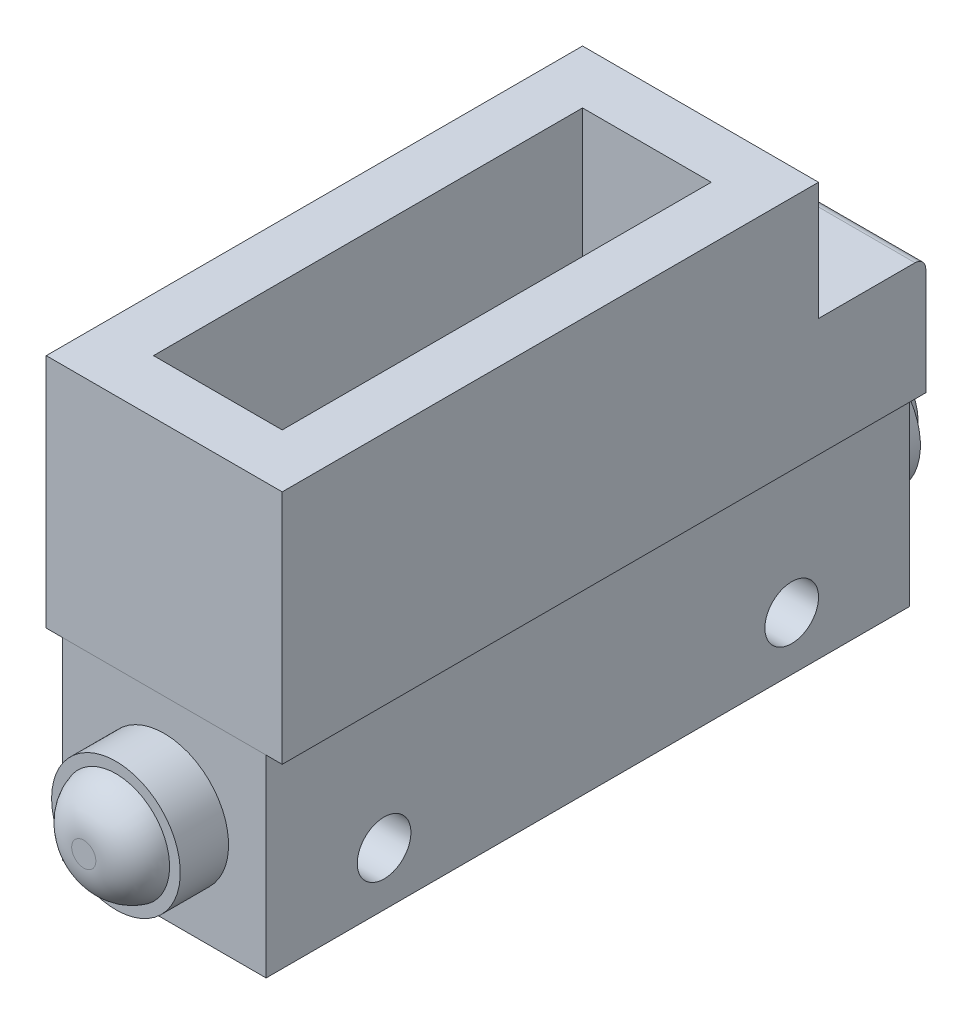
ISO-10303-21;
HEADER;
FILE_DESCRIPTION(('STEP AP214'),'2;1');
FILE_NAME('part.step','',(''),(''),'','','');
FILE_SCHEMA(('AUTOMOTIVE_DESIGN { 1 0 10303 214 1 1 1 1 }'));
ENDSEC;
DATA;
#1=APPLICATION_CONTEXT('core data for automotive mechanical design processes');
#2=APPLICATION_PROTOCOL_DEFINITION('international standard','automotive_design',2000,#1);
#3=PRODUCT_CONTEXT('',#1,'mechanical');
#4=PRODUCT('Part','Part','',(#3));
#5=PRODUCT_RELATED_PRODUCT_CATEGORY('part','',(#4));
#6=PRODUCT_DEFINITION_FORMATION('','',#4);
#7=PRODUCT_DEFINITION_CONTEXT('part definition',#1,'design');
#8=PRODUCT_DEFINITION('design','',#6,#7);
#9=PRODUCT_DEFINITION_SHAPE('','',#8);
#10=(LENGTH_UNIT() NAMED_UNIT(*) SI_UNIT(.MILLI.,.METRE.));
#11=(NAMED_UNIT(*) PLANE_ANGLE_UNIT() SI_UNIT($,.RADIAN.));
#12=(NAMED_UNIT(*) SI_UNIT($,.STERADIAN.) SOLID_ANGLE_UNIT());
#13=UNCERTAINTY_MEASURE_WITH_UNIT(LENGTH_MEASURE(1.E-05),#10,'distance_accuracy_value','');
#14=(GEOMETRIC_REPRESENTATION_CONTEXT(3) GLOBAL_UNCERTAINTY_ASSIGNED_CONTEXT((#13)) GLOBAL_UNIT_ASSIGNED_CONTEXT((#10,
#11,#12)) REPRESENTATION_CONTEXT('',''));
#15=CARTESIAN_POINT('',(0.,0.,0.));
#16=DIRECTION('',(0.,0.,1.));
#17=DIRECTION('',(1.,0.,0.));
#18=AXIS2_PLACEMENT_3D('',#15,#16,#17);
#19=CARTESIAN_POINT('',(0.,-9.,7.5));
#20=DIRECTION('',(0.,0.,1.));
#21=DIRECTION('',(-1.,0.,0.));
#22=AXIS2_PLACEMENT_3D('',#19,#20,#21);
#23=PLANE('',#22);
#24=CARTESIAN_POINT('',(0.,-9.,7.5));
#25=DIRECTION('',(0.,0.,-1.));
#26=DIRECTION('',(-1.,0.,0.));
#27=AXIS2_PLACEMENT_3D('',#24,#25,#26);
#28=CIRCLE('',#27,1.12701665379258);
#29=CARTESIAN_POINT('',(-1.12701665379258,-9.,7.5));
#30=VERTEX_POINT('',#29);
#31=EDGE_CURVE('E11',#30,#30,#28,.T.);
#32=ORIENTED_EDGE('',*,*,#31,.F.);
#33=EDGE_LOOP('',(#32));
#34=FACE_BOUND('',#33,.T.);
#35=ADVANCED_FACE('F46',(#34),#23,.T.);
#36=CARTESIAN_POINT('',(0.,-9.,4.5));
#37=DIRECTION('',(0.,0.,1.));
#38=DIRECTION('',(-1.,0.,0.));
#39=AXIS2_PLACEMENT_3D('',#36,#37,#38);
#40=PLANE('',#39);
#41=CARTESIAN_POINT('',(0.,-9.,4.5));
#42=DIRECTION('',(0.,0.,-1.));
#43=DIRECTION('',(-1.,0.,0.));
#44=AXIS2_PLACEMENT_3D('',#41,#42,#43);
#45=CIRCLE('',#44,5.);
#46=CARTESIAN_POINT('',(-5.,-9.,4.5));
#47=VERTEX_POINT('',#46);
#48=EDGE_CURVE('E53',#47,#47,#45,.T.);
#49=ORIENTED_EDGE('',*,*,#48,.T.);
#50=EDGE_LOOP('',(#49));
#51=FACE_BOUND('',#50,.T.);
#52=ADVANCED_FACE('F59',(#51),#40,.F.);
#53=CARTESIAN_POINT('',(0.,-9.,3.5));
#54=DIRECTION('',(0.,0.,-1.));
#55=DIRECTION('',(1.,0.,0.));
#56=AXIS2_PLACEMENT_3D('',#53,#54,#55);
#57=DEGENERATE_TOROIDAL_SURFACE('',#56,1.12701665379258,4.,.T.);
#58=ORIENTED_EDGE('',*,*,#48,.F.);
#59=EDGE_LOOP('',(#58));
#60=FACE_BOUND('',#59,.T.);
#61=ORIENTED_EDGE('',*,*,#31,.T.);
#62=EDGE_LOOP('',(#61));
#63=FACE_BOUND('',#62,.T.);
#64=ADVANCED_FACE('F48',(#60,#63),#57,.T.);
#65=CLOSED_SHELL('',(#35,#52,#64));
#66=MANIFOLD_SOLID_BREP('B2',#65);
#67=CARTESIAN_POINT('',(0.,-9.,4.5));
#68=DIRECTION('',(0.,0.,-1.));
#69=DIRECTION('',(1.,0.,0.));
#70=AXIS2_PLACEMENT_3D('',#67,#68,#69);
#71=CYLINDRICAL_SURFACE('',#70,6.);
#72=CARTESIAN_POINT('',(0.,-9.,4.5));
#73=DIRECTION('',(0.,0.,-1.));
#74=DIRECTION('',(-1.,0.,0.));
#75=AXIS2_PLACEMENT_3D('',#72,#73,#74);
#76=CIRCLE('',#75,6.);
#77=CARTESIAN_POINT('',(-6.,-9.,4.5));
#78=VERTEX_POINT('',#77);
#79=EDGE_CURVE('E45',#78,#78,#76,.T.);
#80=ORIENTED_EDGE('',*,*,#79,.T.);
#81=EDGE_LOOP('',(#80));
#82=FACE_BOUND('',#81,.T.);
#83=CARTESIAN_POINT('',(0.,-9.,0.));
#84=DIRECTION('',(0.,0.,-1.));
#85=DIRECTION('',(-1.,0.,0.));
#86=AXIS2_PLACEMENT_3D('',#83,#84,#85);
#87=CIRCLE('',#86,6.);
#88=CARTESIAN_POINT('',(-6.,-9.,0.));
#89=VERTEX_POINT('',#88);
#90=EDGE_CURVE('E98',#89,#89,#87,.T.);
#91=ORIENTED_EDGE('',*,*,#90,.F.);
#92=EDGE_LOOP('',(#91));
#93=FACE_BOUND('',#92,.T.);
#94=ADVANCED_FACE('F95',(#82,#93),#71,.T.);
#95=CARTESIAN_POINT('',(0.,-9.,4.5));
#96=DIRECTION('',(0.,0.,1.));
#97=DIRECTION('',(-1.,0.,0.));
#98=AXIS2_PLACEMENT_3D('',#95,#96,#97);
#99=PLANE('',#98);
#100=ORIENTED_EDGE('',*,*,#79,.F.);
#101=EDGE_LOOP('',(#100));
#102=FACE_BOUND('',#101,.T.);
#103=ADVANCED_FACE('F110',(#102),#99,.T.);
#104=CARTESIAN_POINT('',(0.,-9.,0.));
#105=DIRECTION('',(0.,0.,1.));
#106=DIRECTION('',(-1.,0.,0.));
#107=AXIS2_PLACEMENT_3D('',#104,#105,#106);
#108=PLANE('',#107);
#109=ORIENTED_EDGE('',*,*,#90,.T.);
#110=EDGE_LOOP('',(#109));
#111=FACE_BOUND('',#110,.T.);
#112=ADVANCED_FACE('F107',(#111),#108,.F.);
#113=CLOSED_SHELL('',(#94,#103,#112));
#114=MANIFOLD_SOLID_BREP('B6',#113);
#115=CARTESIAN_POINT('',(0.,-9.,-67.5));
#116=DIRECTION('',(0.,0.,-1.));
#117=DIRECTION('',(-1.,0.,0.));
#118=AXIS2_PLACEMENT_3D('',#115,#116,#117);
#119=PLANE('',#118);
#120=CARTESIAN_POINT('',(0.,-9.,-67.5));
#121=DIRECTION('',(0.,0.,-1.));
#122=DIRECTION('',(-1.,0.,0.));
#123=AXIS2_PLACEMENT_3D('',#120,#121,#122);
#124=CIRCLE('',#123,1.12701665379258);
#125=CARTESIAN_POINT('',(-1.12701665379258,-9.,-67.5));
#126=VERTEX_POINT('',#125);
#127=EDGE_CURVE('E94',#126,#126,#124,.T.);
#128=ORIENTED_EDGE('',*,*,#127,.T.);
#129=EDGE_LOOP('',(#128));
#130=FACE_BOUND('',#129,.T.);
#131=ADVANCED_FACE('F144',(#130),#119,.T.);
#132=CARTESIAN_POINT('',(0.,-9.,-64.5));
#133=DIRECTION('',(0.,0.,-1.));
#134=DIRECTION('',(-1.,0.,0.));
#135=AXIS2_PLACEMENT_3D('',#132,#133,#134);
#136=PLANE('',#135);
#137=CARTESIAN_POINT('',(0.,-9.,-64.5));
#138=DIRECTION('',(0.,0.,-1.));
#139=DIRECTION('',(-1.,0.,0.));
#140=AXIS2_PLACEMENT_3D('',#137,#138,#139);
#141=CIRCLE('',#140,5.);
#142=CARTESIAN_POINT('',(-5.,-9.,-64.5));
#143=VERTEX_POINT('',#142);
#144=EDGE_CURVE('E151',#143,#143,#141,.T.);
#145=ORIENTED_EDGE('',*,*,#144,.F.);
#146=EDGE_LOOP('',(#145));
#147=FACE_BOUND('',#146,.T.);
#148=ADVANCED_FACE('F159',(#147),#136,.F.);
#149=CARTESIAN_POINT('',(0.,-9.,-63.5));
#150=DIRECTION('',(0.,0.,1.));
#151=DIRECTION('',(1.,0.,0.));
#152=AXIS2_PLACEMENT_3D('',#149,#150,#151);
#153=DEGENERATE_TOROIDAL_SURFACE('',#152,1.12701665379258,4.,.T.);
#154=ORIENTED_EDGE('',*,*,#144,.T.);
#155=EDGE_LOOP('',(#154));
#156=FACE_BOUND('',#155,.T.);
#157=ORIENTED_EDGE('',*,*,#127,.F.);
#158=EDGE_LOOP('',(#157));
#159=FACE_BOUND('',#158,.T.);
#160=ADVANCED_FACE('F146',(#156,#159),#153,.T.);
#161=CLOSED_SHELL('',(#131,#148,#160));
#162=MANIFOLD_SOLID_BREP('B40',#161);
#163=CARTESIAN_POINT('',(0.,-9.,-64.5));
#164=DIRECTION('',(0.,0.,1.));
#165=DIRECTION('',(1.,0.,0.));
#166=AXIS2_PLACEMENT_3D('',#163,#164,#165);
#167=CYLINDRICAL_SURFACE('',#166,6.);
#168=CARTESIAN_POINT('',(0.,-9.,-64.5));
#169=DIRECTION('',(0.,0.,-1.));
#170=DIRECTION('',(-1.,0.,0.));
#171=AXIS2_PLACEMENT_3D('',#168,#169,#170);
#172=CIRCLE('',#171,6.);
#173=CARTESIAN_POINT('',(-6.,-9.,-64.5));
#174=VERTEX_POINT('',#173);
#175=EDGE_CURVE('E143',#174,#174,#172,.T.);
#176=ORIENTED_EDGE('',*,*,#175,.F.);
#177=EDGE_LOOP('',(#176));
#178=FACE_BOUND('',#177,.T.);
#179=CARTESIAN_POINT('',(0.,-9.,-60.));
#180=DIRECTION('',(0.,0.,-1.));
#181=DIRECTION('',(-1.,0.,0.));
#182=AXIS2_PLACEMENT_3D('',#179,#180,#181);
#183=CIRCLE('',#182,6.);
#184=CARTESIAN_POINT('',(-6.,-9.,-60.));
#185=VERTEX_POINT('',#184);
#186=EDGE_CURVE('E198',#185,#185,#183,.T.);
#187=ORIENTED_EDGE('',*,*,#186,.T.);
#188=EDGE_LOOP('',(#187));
#189=FACE_BOUND('',#188,.T.);
#190=ADVANCED_FACE('F195',(#178,#189),#167,.T.);
#191=CARTESIAN_POINT('',(0.,-9.,-64.5));
#192=DIRECTION('',(0.,0.,-1.));
#193=DIRECTION('',(-1.,0.,0.));
#194=AXIS2_PLACEMENT_3D('',#191,#192,#193);
#195=PLANE('',#194);
#196=ORIENTED_EDGE('',*,*,#175,.T.);
#197=EDGE_LOOP('',(#196));
#198=FACE_BOUND('',#197,.T.);
#199=ADVANCED_FACE('F210',(#198),#195,.T.);
#200=CARTESIAN_POINT('',(0.,-9.,-60.));
#201=DIRECTION('',(0.,0.,-1.));
#202=DIRECTION('',(-1.,0.,0.));
#203=AXIS2_PLACEMENT_3D('',#200,#201,#202);
#204=PLANE('',#203);
#205=ORIENTED_EDGE('',*,*,#186,.F.);
#206=EDGE_LOOP('',(#205));
#207=FACE_BOUND('',#206,.T.);
#208=ADVANCED_FACE('F208',(#207),#204,.F.);
#209=CLOSED_SHELL('',(#190,#199,#208));
#210=MANIFOLD_SOLID_BREP('B89',#209);
#211=CARTESIAN_POINT('',(9.5,0.,0.));
#212=DIRECTION('',(1.,0.,0.));
#213=DIRECTION('',(0.,0.,-1.));
#214=AXIS2_PLACEMENT_3D('',#211,#212,#213);
#215=PLANE('',#214);
#216=CARTESIAN_POINT('',(9.5,-13.,-11.));
#217=DIRECTION('',(1.,0.,0.));
#218=DIRECTION('',(0.,0.,-1.));
#219=AXIS2_PLACEMENT_3D('',#216,#217,#218);
#220=CIRCLE('',#219,2.5);
#221=CARTESIAN_POINT('',(9.5,-13.,-13.5));
#222=VERTEX_POINT('',#221);
#223=EDGE_CURVE('E312',#222,#222,#220,.T.);
#224=ORIENTED_EDGE('',*,*,#223,.F.);
#225=EDGE_LOOP('',(#224));
#226=FACE_BOUND('',#225,.T.);
#227=DIRECTION('',(0.,-1.,0.));
#228=VECTOR('',#227,1.);
#229=CARTESIAN_POINT('',(9.5,0.,0.));
#230=LINE('',#229,#228);
#231=CARTESIAN_POINT('',(9.5,0.,0.));
#232=VERTEX_POINT('',#231);
#233=CARTESIAN_POINT('',(9.5,-18.,0.));
#234=VERTEX_POINT('',#233);
#235=EDGE_CURVE('E297',#232,#234,#230,.T.);
#236=ORIENTED_EDGE('',*,*,#235,.T.);
#237=DIRECTION('',(0.,0.,-1.));
#238=VECTOR('',#237,1.);
#239=CARTESIAN_POINT('',(9.5,-18.,0.));
#240=LINE('',#239,#238);
#241=CARTESIAN_POINT('',(9.5,-18.,-60.));
#242=VERTEX_POINT('',#241);
#243=EDGE_CURVE('E292',#234,#242,#240,.T.);
#244=ORIENTED_EDGE('',*,*,#243,.T.);
#245=DIRECTION('',(0.,1.,0.));
#246=VECTOR('',#245,1.);
#247=CARTESIAN_POINT('',(9.5,0.,-60.));
#248=LINE('',#247,#246);
#249=CARTESIAN_POINT('',(9.5,0.,-60.));
#250=VERTEX_POINT('',#249);
#251=EDGE_CURVE('E295',#242,#250,#248,.T.);
#252=ORIENTED_EDGE('',*,*,#251,.T.);
#253=DIRECTION('',(0.,0.,1.));
#254=VECTOR('',#253,1.);
#255=CARTESIAN_POINT('',(9.5,0.,0.));
#256=LINE('',#255,#254);
#257=EDGE_CURVE('E262',#250,#232,#256,.T.);
#258=ORIENTED_EDGE('',*,*,#257,.T.);
#259=EDGE_LOOP('',(#236,#244,#252,#258));
#260=FACE_BOUND('',#259,.T.);
#261=CARTESIAN_POINT('',(9.5,-13.,-49.));
#262=DIRECTION('',(1.,0.,0.));
#263=DIRECTION('',(0.,0.,-1.));
#264=AXIS2_PLACEMENT_3D('',#261,#262,#263);
#265=CIRCLE('',#264,2.5);
#266=CARTESIAN_POINT('',(9.5,-13.,-51.5));
#267=VERTEX_POINT('',#266);
#268=EDGE_CURVE('E327',#267,#267,#265,.T.);
#269=ORIENTED_EDGE('',*,*,#268,.F.);
#270=EDGE_LOOP('',(#269));
#271=FACE_BOUND('',#270,.T.);
#272=ADVANCED_FACE('F245',(#226,#260,#271),#215,.T.);
#273=CARTESIAN_POINT('',(-9.5,0.,0.));
#274=DIRECTION('',(1.,0.,0.));
#275=DIRECTION('',(0.,0.,-1.));
#276=AXIS2_PLACEMENT_3D('',#273,#274,#275);
#277=PLANE('',#276);
#278=DIRECTION('',(0.,-1.,0.));
#279=VECTOR('',#278,1.);
#280=CARTESIAN_POINT('',(-9.5,0.,0.));
#281=LINE('',#280,#279);
#282=CARTESIAN_POINT('',(-9.5,0.,0.));
#283=VERTEX_POINT('',#282);
#284=CARTESIAN_POINT('',(-9.5,-18.,0.));
#285=VERTEX_POINT('',#284);
#286=EDGE_CURVE('E309',#283,#285,#281,.T.);
#287=ORIENTED_EDGE('',*,*,#286,.F.);
#288=DIRECTION('',(0.,0.,1.));
#289=VECTOR('',#288,1.);
#290=CARTESIAN_POINT('',(-9.5,0.,0.));
#291=LINE('',#290,#289);
#292=CARTESIAN_POINT('',(-9.5,0.,-60.));
#293=VERTEX_POINT('',#292);
#294=EDGE_CURVE('E285',#293,#283,#291,.T.);
#295=ORIENTED_EDGE('',*,*,#294,.F.);
#296=DIRECTION('',(0.,1.,0.));
#297=VECTOR('',#296,1.);
#298=CARTESIAN_POINT('',(-9.5,0.,-60.));
#299=LINE('',#298,#297);
#300=CARTESIAN_POINT('',(-9.5,-18.,-60.));
#301=VERTEX_POINT('',#300);
#302=EDGE_CURVE('E279',#301,#293,#299,.T.);
#303=ORIENTED_EDGE('',*,*,#302,.F.);
#304=DIRECTION('',(0.,0.,-1.));
#305=VECTOR('',#304,1.);
#306=CARTESIAN_POINT('',(-9.5,-18.,0.));
#307=LINE('',#306,#305);
#308=EDGE_CURVE('E301',#285,#301,#307,.T.);
#309=ORIENTED_EDGE('',*,*,#308,.F.);
#310=EDGE_LOOP('',(#287,#295,#303,#309));
#311=FACE_BOUND('',#310,.T.);
#312=CARTESIAN_POINT('',(-9.5,-13.,-11.));
#313=DIRECTION('',(1.,0.,0.));
#314=DIRECTION('',(0.,0.,-1.));
#315=AXIS2_PLACEMENT_3D('',#312,#313,#314);
#316=CIRCLE('',#315,2.5);
#317=CARTESIAN_POINT('',(-9.5,-13.,-13.5));
#318=VERTEX_POINT('',#317);
#319=EDGE_CURVE('E324',#318,#318,#316,.T.);
#320=ORIENTED_EDGE('',*,*,#319,.T.);
#321=EDGE_LOOP('',(#320));
#322=FACE_BOUND('',#321,.T.);
#323=CARTESIAN_POINT('',(-9.5,-13.,-49.));
#324=DIRECTION('',(1.,0.,0.));
#325=DIRECTION('',(0.,0.,-1.));
#326=AXIS2_PLACEMENT_3D('',#323,#324,#325);
#327=CIRCLE('',#326,2.5);
#328=CARTESIAN_POINT('',(-9.5,-13.,-51.5));
#329=VERTEX_POINT('',#328);
#330=EDGE_CURVE('E330',#329,#329,#327,.T.);
#331=ORIENTED_EDGE('',*,*,#330,.T.);
#332=EDGE_LOOP('',(#331));
#333=FACE_BOUND('',#332,.T.);
#334=ADVANCED_FACE('F320',(#311,#322,#333),#277,.F.);
#335=CARTESIAN_POINT('',(9.5,0.,0.));
#336=DIRECTION('',(0.,0.,-1.));
#337=DIRECTION('',(-1.,0.,0.));
#338=AXIS2_PLACEMENT_3D('',#335,#336,#337);
#339=PLANE('',#338);
#340=ORIENTED_EDGE('',*,*,#286,.T.);
#341=DIRECTION('',(-1.,0.,0.));
#342=VECTOR('',#341,1.);
#343=CARTESIAN_POINT('',(9.5,-18.,0.));
#344=LINE('',#343,#342);
#345=EDGE_CURVE('E193',#234,#285,#344,.T.);
#346=ORIENTED_EDGE('',*,*,#345,.F.);
#347=ORIENTED_EDGE('',*,*,#235,.F.);
#348=DIRECTION('',(-1.,0.,0.));
#349=VECTOR('',#348,1.);
#350=CARTESIAN_POINT('',(9.5,0.,0.));
#351=LINE('',#350,#349);
#352=EDGE_CURVE('E305',#232,#283,#351,.T.);
#353=ORIENTED_EDGE('',*,*,#352,.T.);
#354=EDGE_LOOP('',(#340,#346,#347,#353));
#355=FACE_BOUND('',#354,.T.);
#356=ADVANCED_FACE('F247',(#355),#339,.F.);
#357=CARTESIAN_POINT('',(9.5,-18.,0.));
#358=DIRECTION('',(0.,1.,0.));
#359=DIRECTION('',(0.,0.,1.));
#360=AXIS2_PLACEMENT_3D('',#357,#358,#359);
#361=PLANE('',#360);
#362=ORIENTED_EDGE('',*,*,#308,.T.);
#363=DIRECTION('',(-1.,0.,0.));
#364=VECTOR('',#363,1.);
#365=CARTESIAN_POINT('',(9.5,-18.,-60.));
#366=LINE('',#365,#364);
#367=EDGE_CURVE('E254',#242,#301,#366,.T.);
#368=ORIENTED_EDGE('',*,*,#367,.F.);
#369=ORIENTED_EDGE('',*,*,#243,.F.);
#370=ORIENTED_EDGE('',*,*,#345,.T.);
#371=EDGE_LOOP('',(#362,#368,#369,#370));
#372=FACE_BOUND('',#371,.T.);
#373=ADVANCED_FACE('F300',(#372),#361,.F.);
#374=CARTESIAN_POINT('',(9.5,0.,-60.));
#375=DIRECTION('',(0.,0.,1.));
#376=DIRECTION('',(1.,0.,0.));
#377=AXIS2_PLACEMENT_3D('',#374,#375,#376);
#378=PLANE('',#377);
#379=ORIENTED_EDGE('',*,*,#302,.T.);
#380=DIRECTION('',(-1.,0.,0.));
#381=VECTOR('',#380,1.);
#382=CARTESIAN_POINT('',(9.5,0.,-60.));
#383=LINE('',#382,#381);
#384=EDGE_CURVE('E302',#250,#293,#383,.T.);
#385=ORIENTED_EDGE('',*,*,#384,.F.);
#386=ORIENTED_EDGE('',*,*,#251,.F.);
#387=ORIENTED_EDGE('',*,*,#367,.T.);
#388=EDGE_LOOP('',(#379,#385,#386,#387));
#389=FACE_BOUND('',#388,.T.);
#390=ADVANCED_FACE('F303',(#389),#378,.F.);
#391=CARTESIAN_POINT('',(9.5,0.,0.));
#392=DIRECTION('',(0.,-1.,0.));
#393=DIRECTION('',(0.,0.,-1.));
#394=AXIS2_PLACEMENT_3D('',#391,#392,#393);
#395=PLANE('',#394);
#396=ORIENTED_EDGE('',*,*,#294,.T.);
#397=ORIENTED_EDGE('',*,*,#352,.F.);
#398=ORIENTED_EDGE('',*,*,#257,.F.);
#399=ORIENTED_EDGE('',*,*,#384,.T.);
#400=EDGE_LOOP('',(#396,#397,#398,#399));
#401=FACE_BOUND('',#400,.T.);
#402=ADVANCED_FACE('F317',(#401),#395,.F.);
#403=CARTESIAN_POINT('',(9.5,-13.,-11.));
#404=DIRECTION('',(-1.,0.,0.));
#405=DIRECTION('',(0.,0.,1.));
#406=AXIS2_PLACEMENT_3D('',#403,#404,#405);
#407=CYLINDRICAL_SURFACE('',#406,2.5);
#408=ORIENTED_EDGE('',*,*,#223,.T.);
#409=EDGE_LOOP('',(#408));
#410=FACE_BOUND('',#409,.T.);
#411=ORIENTED_EDGE('',*,*,#319,.F.);
#412=EDGE_LOOP('',(#411));
#413=FACE_BOUND('',#412,.T.);
#414=ADVANCED_FACE('F347',(#410,#413),#407,.F.);
#415=CARTESIAN_POINT('',(9.5,-13.,-49.));
#416=DIRECTION('',(-1.,0.,0.));
#417=DIRECTION('',(0.,0.,1.));
#418=AXIS2_PLACEMENT_3D('',#415,#416,#417);
#419=CYLINDRICAL_SURFACE('',#418,2.5);
#420=ORIENTED_EDGE('',*,*,#268,.T.);
#421=EDGE_LOOP('',(#420));
#422=FACE_BOUND('',#421,.T.);
#423=ORIENTED_EDGE('',*,*,#330,.F.);
#424=EDGE_LOOP('',(#423));
#425=FACE_BOUND('',#424,.T.);
#426=ADVANCED_FACE('F336',(#422,#425),#419,.F.);
#427=CLOSED_SHELL('',(#272,#334,#356,#373,#390,#402,#414,#426));
#428=MANIFOLD_SOLID_BREP('B138',#427);
#429=CARTESIAN_POINT('',(11.,0.,0.));
#430=DIRECTION('',(0.,0.,-1.));
#431=DIRECTION('',(-1.,0.,0.));
#432=AXIS2_PLACEMENT_3D('',#429,#430,#431);
#433=PLANE('',#432);
#434=DIRECTION('',(0.,-1.,0.));
#435=VECTOR('',#434,1.);
#436=CARTESIAN_POINT('',(-11.,0.,0.));
#437=LINE('',#436,#435);
#438=CARTESIAN_POINT('',(-11.,22.,0.));
#439=VERTEX_POINT('',#438);
#440=CARTESIAN_POINT('',(-11.,0.,0.));
#441=VERTEX_POINT('',#440);
#442=EDGE_CURVE('E526',#439,#441,#437,.T.);
#443=ORIENTED_EDGE('',*,*,#442,.T.);
#444=DIRECTION('',(-1.,0.,0.));
#445=VECTOR('',#444,1.);
#446=CARTESIAN_POINT('',(11.,0.,0.));
#447=LINE('',#446,#445);
#448=CARTESIAN_POINT('',(11.,0.,0.));
#449=VERTEX_POINT('',#448);
#450=EDGE_CURVE('E243',#449,#441,#447,.T.);
#451=ORIENTED_EDGE('',*,*,#450,.F.);
#452=DIRECTION('',(0.,-1.,0.));
#453=VECTOR('',#452,1.);
#454=CARTESIAN_POINT('',(11.,0.,0.));
#455=LINE('',#454,#453);
#456=CARTESIAN_POINT('',(11.,22.,0.));
#457=VERTEX_POINT('',#456);
#458=EDGE_CURVE('E530',#457,#449,#455,.T.);
#459=ORIENTED_EDGE('',*,*,#458,.F.);
#460=DIRECTION('',(-1.,0.,0.));
#461=VECTOR('',#460,1.);
#462=CARTESIAN_POINT('',(11.,22.,0.));
#463=LINE('',#462,#461);
#464=EDGE_CURVE('E546',#457,#439,#463,.T.);
#465=ORIENTED_EDGE('',*,*,#464,.T.);
#466=EDGE_LOOP('',(#443,#451,#459,#465));
#467=FACE_BOUND('',#466,.T.);
#468=ADVANCED_FACE('F411',(#467),#433,.F.);
#469=CARTESIAN_POINT('',(11.,0.,-50.));
#470=DIRECTION('',(0.,1.,0.));
#471=DIRECTION('',(0.,0.,1.));
#472=AXIS2_PLACEMENT_3D('',#469,#470,#471);
#473=PLANE('',#472);
#474=DIRECTION('',(0.,0.,-1.));
#475=VECTOR('',#474,1.);
#476=CARTESIAN_POINT('',(6.,0.,-5.));
#477=LINE('',#476,#475);
#478=CARTESIAN_POINT('',(6.,0.,-5.));
#479=VERTEX_POINT('',#478);
#480=CARTESIAN_POINT('',(6.,0.,-45.));
#481=VERTEX_POINT('',#480);
#482=EDGE_CURVE('E501',#479,#481,#477,.T.);
#483=ORIENTED_EDGE('',*,*,#482,.T.);
#484=DIRECTION('',(-1.,0.,0.));
#485=VECTOR('',#484,1.);
#486=CARTESIAN_POINT('',(6.,0.,-45.));
#487=LINE('',#486,#485);
#488=CARTESIAN_POINT('',(-6.,0.,-45.));
#489=VERTEX_POINT('',#488);
#490=EDGE_CURVE('E495',#481,#489,#487,.T.);
#491=ORIENTED_EDGE('',*,*,#490,.T.);
#492=DIRECTION('',(0.,0.,1.));
#493=VECTOR('',#492,1.);
#494=CARTESIAN_POINT('',(-6.,0.,-45.));
#495=LINE('',#494,#493);
#496=CARTESIAN_POINT('',(-6.,0.,-5.));
#497=VERTEX_POINT('',#496);
#498=EDGE_CURVE('E504',#489,#497,#495,.T.);
#499=ORIENTED_EDGE('',*,*,#498,.T.);
#500=DIRECTION('',(1.,0.,0.));
#501=VECTOR('',#500,1.);
#502=CARTESIAN_POINT('',(-6.,0.,-5.));
#503=LINE('',#502,#501);
#504=EDGE_CURVE('E425',#497,#479,#503,.T.);
#505=ORIENTED_EDGE('',*,*,#504,.T.);
#506=EDGE_LOOP('',(#483,#491,#499,#505));
#507=FACE_BOUND('',#506,.T.);
#508=DIRECTION('',(0.,0.,-1.));
#509=VECTOR('',#508,1.);
#510=CARTESIAN_POINT('',(-11.,0.,-50.));
#511=LINE('',#510,#509);
#512=CARTESIAN_POINT('',(-11.,0.,-60.));
#513=VERTEX_POINT('',#512);
#514=EDGE_CURVE('E549',#441,#513,#511,.T.);
#515=ORIENTED_EDGE('',*,*,#514,.T.);
#516=DIRECTION('',(-1.,0.,0.));
#517=VECTOR('',#516,1.);
#518=CARTESIAN_POINT('',(11.,0.,-60.));
#519=LINE('',#518,#517);
#520=CARTESIAN_POINT('',(11.,0.,-60.));
#521=VERTEX_POINT('',#520);
#522=EDGE_CURVE('E418',#521,#513,#519,.T.);
#523=ORIENTED_EDGE('',*,*,#522,.F.);
#524=DIRECTION('',(0.,0.,-1.));
#525=VECTOR('',#524,1.);
#526=CARTESIAN_POINT('',(11.,0.,0.));
#527=LINE('',#526,#525);
#528=EDGE_CURVE('E533',#449,#521,#527,.T.);
#529=ORIENTED_EDGE('',*,*,#528,.F.);
#530=ORIENTED_EDGE('',*,*,#450,.T.);
#531=EDGE_LOOP('',(#515,#523,#529,#530));
#532=FACE_BOUND('',#531,.T.);
#533=ADVANCED_FACE('F508',(#507,#532),#473,.F.);
#534=CARTESIAN_POINT('',(11.,0.,-60.));
#535=DIRECTION('',(0.,0.,1.));
#536=DIRECTION('',(1.,0.,0.));
#537=AXIS2_PLACEMENT_3D('',#534,#535,#536);
#538=PLANE('',#537);
#539=DIRECTION('',(0.,1.,0.));
#540=VECTOR('',#539,1.);
#541=CARTESIAN_POINT('',(-11.,0.,-60.));
#542=LINE('',#541,#540);
#543=CARTESIAN_POINT('',(-11.,9.99999999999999,-60.));
#544=VERTEX_POINT('',#543);
#545=EDGE_CURVE('E551',#513,#544,#542,.T.);
#546=ORIENTED_EDGE('',*,*,#545,.T.);
#547=DIRECTION('',(-1.,0.,0.));
#548=VECTOR('',#547,1.);
#549=CARTESIAN_POINT('',(11.,9.99999999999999,-60.));
#550=LINE('',#549,#548);
#551=CARTESIAN_POINT('',(11.,9.99999999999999,-60.));
#552=VERTEX_POINT('',#551);
#553=EDGE_CURVE('E571',#552,#544,#550,.T.);
#554=ORIENTED_EDGE('',*,*,#553,.F.);
#555=DIRECTION('',(0.,1.,0.));
#556=VECTOR('',#555,1.);
#557=CARTESIAN_POINT('',(11.,0.,-60.));
#558=LINE('',#557,#556);
#559=EDGE_CURVE('E536',#521,#552,#558,.T.);
#560=ORIENTED_EDGE('',*,*,#559,.F.);
#561=ORIENTED_EDGE('',*,*,#522,.T.);
#562=EDGE_LOOP('',(#546,#554,#560,#561));
#563=FACE_BOUND('',#562,.T.);
#564=ADVANCED_FACE('F578',(#563),#538,.F.);
#565=CARTESIAN_POINT('',(11.,10.,-59.));
#566=DIRECTION('',(-1.,0.,0.));
#567=DIRECTION('',(0.,0.,1.));
#568=AXIS2_PLACEMENT_3D('',#565,#566,#567);
#569=CYLINDRICAL_SURFACE('',#568,1.);
#570=CARTESIAN_POINT('',(-11.,10.,-59.));
#571=DIRECTION('',(1.,0.,0.));
#572=DIRECTION('',(0.,0.,1.));
#573=AXIS2_PLACEMENT_3D('',#570,#571,#572);
#574=CIRCLE('',#573,1.);
#575=CARTESIAN_POINT('',(-11.,11.,-59.));
#576=VERTEX_POINT('',#575);
#577=EDGE_CURVE('E553',#544,#576,#574,.T.);
#578=ORIENTED_EDGE('',*,*,#577,.T.);
#579=DIRECTION('',(-1.,0.,0.));
#580=VECTOR('',#579,1.);
#581=CARTESIAN_POINT('',(11.,11.,-59.));
#582=LINE('',#581,#580);
#583=CARTESIAN_POINT('',(11.,11.,-59.));
#584=VERTEX_POINT('',#583);
#585=EDGE_CURVE('E568',#584,#576,#582,.T.);
#586=ORIENTED_EDGE('',*,*,#585,.F.);
#587=CARTESIAN_POINT('',(11.,10.,-59.));
#588=DIRECTION('',(1.,0.,0.));
#589=DIRECTION('',(0.,0.,1.));
#590=AXIS2_PLACEMENT_3D('',#587,#588,#589);
#591=CIRCLE('',#590,1.);
#592=EDGE_CURVE('E538',#552,#584,#591,.T.);
#593=ORIENTED_EDGE('',*,*,#592,.F.);
#594=ORIENTED_EDGE('',*,*,#553,.T.);
#595=EDGE_LOOP('',(#578,#586,#593,#594));
#596=FACE_BOUND('',#595,.T.);
#597=ADVANCED_FACE('F588',(#596),#569,.T.);
#598=CARTESIAN_POINT('',(11.,11.,-50.));
#599=DIRECTION('',(0.,-1.,0.));
#600=DIRECTION('',(0.,0.,-1.));
#601=AXIS2_PLACEMENT_3D('',#598,#599,#600);
#602=PLANE('',#601);
#603=DIRECTION('',(0.,0.,1.));
#604=VECTOR('',#603,1.);
#605=CARTESIAN_POINT('',(-11.,11.,-50.));
#606=LINE('',#605,#604);
#607=CARTESIAN_POINT('',(-11.,11.,-50.));
#608=VERTEX_POINT('',#607);
#609=EDGE_CURVE('E555',#576,#608,#606,.T.);
#610=ORIENTED_EDGE('',*,*,#609,.T.);
#611=DIRECTION('',(-1.,0.,0.));
#612=VECTOR('',#611,1.);
#613=CARTESIAN_POINT('',(11.,11.,-50.));
#614=LINE('',#613,#612);
#615=CARTESIAN_POINT('',(11.,11.,-50.));
#616=VERTEX_POINT('',#615);
#617=EDGE_CURVE('E565',#616,#608,#614,.T.);
#618=ORIENTED_EDGE('',*,*,#617,.F.);
#619=DIRECTION('',(0.,0.,1.));
#620=VECTOR('',#619,1.);
#621=CARTESIAN_POINT('',(11.,11.,-50.));
#622=LINE('',#621,#620);
#623=EDGE_CURVE('E540',#584,#616,#622,.T.);
#624=ORIENTED_EDGE('',*,*,#623,.F.);
#625=ORIENTED_EDGE('',*,*,#585,.T.);
#626=EDGE_LOOP('',(#610,#618,#624,#625));
#627=FACE_BOUND('',#626,.T.);
#628=ADVANCED_FACE('F592',(#627),#602,.F.);
#629=CARTESIAN_POINT('',(11.,11.,-50.));
#630=DIRECTION('',(0.,0.,1.));
#631=DIRECTION('',(1.,0.,0.));
#632=AXIS2_PLACEMENT_3D('',#629,#630,#631);
#633=PLANE('',#632);
#634=DIRECTION('',(0.,1.,0.));
#635=VECTOR('',#634,1.);
#636=CARTESIAN_POINT('',(-11.,11.,-50.));
#637=LINE('',#636,#635);
#638=CARTESIAN_POINT('',(-11.,22.,-50.));
#639=VERTEX_POINT('',#638);
#640=EDGE_CURVE('E557',#608,#639,#637,.T.);
#641=ORIENTED_EDGE('',*,*,#640,.T.);
#642=DIRECTION('',(-1.,0.,0.));
#643=VECTOR('',#642,1.);
#644=CARTESIAN_POINT('',(11.,22.,-50.));
#645=LINE('',#644,#643);
#646=CARTESIAN_POINT('',(11.,22.,-50.));
#647=VERTEX_POINT('',#646);
#648=EDGE_CURVE('E562',#647,#639,#645,.T.);
#649=ORIENTED_EDGE('',*,*,#648,.F.);
#650=DIRECTION('',(0.,1.,0.));
#651=VECTOR('',#650,1.);
#652=CARTESIAN_POINT('',(11.,11.,-50.));
#653=LINE('',#652,#651);
#654=EDGE_CURVE('E542',#616,#647,#653,.T.);
#655=ORIENTED_EDGE('',*,*,#654,.F.);
#656=ORIENTED_EDGE('',*,*,#617,.T.);
#657=EDGE_LOOP('',(#641,#649,#655,#656));
#658=FACE_BOUND('',#657,.T.);
#659=ADVANCED_FACE('F607',(#658),#633,.F.);
#660=CARTESIAN_POINT('',(11.,22.,0.));
#661=DIRECTION('',(0.,-1.,0.));
#662=DIRECTION('',(0.,0.,-1.));
#663=AXIS2_PLACEMENT_3D('',#660,#661,#662);
#664=PLANE('',#663);
#665=DIRECTION('',(0.,0.,1.));
#666=VECTOR('',#665,1.);
#667=CARTESIAN_POINT('',(-6.,22.,-45.));
#668=LINE('',#667,#666);
#669=CARTESIAN_POINT('',(-6.,22.,-45.));
#670=VERTEX_POINT('',#669);
#671=CARTESIAN_POINT('',(-6.,22.,-5.));
#672=VERTEX_POINT('',#671);
#673=EDGE_CURVE('E520',#670,#672,#668,.T.);
#674=ORIENTED_EDGE('',*,*,#673,.F.);
#675=DIRECTION('',(-1.,0.,0.));
#676=VECTOR('',#675,1.);
#677=CARTESIAN_POINT('',(6.,22.,-45.));
#678=LINE('',#677,#676);
#679=CARTESIAN_POINT('',(6.,22.,-45.));
#680=VERTEX_POINT('',#679);
#681=EDGE_CURVE('E433',#680,#670,#678,.T.);
#682=ORIENTED_EDGE('',*,*,#681,.F.);
#683=DIRECTION('',(0.,0.,-1.));
#684=VECTOR('',#683,1.);
#685=CARTESIAN_POINT('',(6.,22.,-5.));
#686=LINE('',#685,#684);
#687=CARTESIAN_POINT('',(6.,22.,-5.));
#688=VERTEX_POINT('',#687);
#689=EDGE_CURVE('E511',#688,#680,#686,.T.);
#690=ORIENTED_EDGE('',*,*,#689,.F.);
#691=DIRECTION('',(1.,0.,0.));
#692=VECTOR('',#691,1.);
#693=CARTESIAN_POINT('',(-6.,22.,-5.));
#694=LINE('',#693,#692);
#695=EDGE_CURVE('E514',#672,#688,#694,.T.);
#696=ORIENTED_EDGE('',*,*,#695,.F.);
#697=EDGE_LOOP('',(#674,#682,#690,#696));
#698=FACE_BOUND('',#697,.T.);
#699=DIRECTION('',(0.,0.,1.));
#700=VECTOR('',#699,1.);
#701=CARTESIAN_POINT('',(-11.,22.,0.));
#702=LINE('',#701,#700);
#703=EDGE_CURVE('E534',#639,#439,#702,.T.);
#704=ORIENTED_EDGE('',*,*,#703,.T.);
#705=ORIENTED_EDGE('',*,*,#464,.F.);
#706=DIRECTION('',(0.,0.,1.));
#707=VECTOR('',#706,1.);
#708=CARTESIAN_POINT('',(11.,22.,0.));
#709=LINE('',#708,#707);
#710=EDGE_CURVE('E544',#647,#457,#709,.T.);
#711=ORIENTED_EDGE('',*,*,#710,.F.);
#712=ORIENTED_EDGE('',*,*,#648,.T.);
#713=EDGE_LOOP('',(#704,#705,#711,#712));
#714=FACE_BOUND('',#713,.T.);
#715=ADVANCED_FACE('F604',(#698,#714),#664,.F.);
#716=CARTESIAN_POINT('',(11.,10.,-59.));
#717=DIRECTION('',(-1.,0.,0.));
#718=DIRECTION('',(0.,0.,1.));
#719=AXIS2_PLACEMENT_3D('',#716,#717,#718);
#720=PLANE('',#719);
#721=ORIENTED_EDGE('',*,*,#458,.T.);
#722=ORIENTED_EDGE('',*,*,#528,.T.);
#723=ORIENTED_EDGE('',*,*,#559,.T.);
#724=ORIENTED_EDGE('',*,*,#592,.T.);
#725=ORIENTED_EDGE('',*,*,#623,.T.);
#726=ORIENTED_EDGE('',*,*,#654,.T.);
#727=ORIENTED_EDGE('',*,*,#710,.T.);
#728=EDGE_LOOP('',(#721,#722,#723,#724,#725,#726,#727));
#729=FACE_BOUND('',#728,.T.);
#730=ADVANCED_FACE('F596',(#729),#720,.F.);
#731=CARTESIAN_POINT('',(-11.,10.,-59.));
#732=DIRECTION('',(-1.,0.,0.));
#733=DIRECTION('',(0.,0.,1.));
#734=AXIS2_PLACEMENT_3D('',#731,#732,#733);
#735=PLANE('',#734);
#736=ORIENTED_EDGE('',*,*,#442,.F.);
#737=ORIENTED_EDGE('',*,*,#703,.F.);
#738=ORIENTED_EDGE('',*,*,#640,.F.);
#739=ORIENTED_EDGE('',*,*,#609,.F.);
#740=ORIENTED_EDGE('',*,*,#577,.F.);
#741=ORIENTED_EDGE('',*,*,#545,.F.);
#742=ORIENTED_EDGE('',*,*,#514,.F.);
#743=EDGE_LOOP('',(#736,#737,#738,#739,#740,#741,#742));
#744=FACE_BOUND('',#743,.T.);
#745=ADVANCED_FACE('F583',(#744),#735,.T.);
#746=CARTESIAN_POINT('',(6.,0.,-45.));
#747=DIRECTION('',(0.,0.,-1.));
#748=DIRECTION('',(-1.,0.,0.));
#749=AXIS2_PLACEMENT_3D('',#746,#747,#748);
#750=PLANE('',#749);
#751=ORIENTED_EDGE('',*,*,#681,.T.);
#752=DIRECTION('',(0.,1.,0.));
#753=VECTOR('',#752,1.);
#754=CARTESIAN_POINT('',(-6.,0.,-45.));
#755=LINE('',#754,#753);
#756=EDGE_CURVE('E491',#489,#670,#755,.T.);
#757=ORIENTED_EDGE('',*,*,#756,.F.);
#758=ORIENTED_EDGE('',*,*,#490,.F.);
#759=DIRECTION('',(0.,1.,0.));
#760=VECTOR('',#759,1.);
#761=CARTESIAN_POINT('',(6.,0.,-45.));
#762=LINE('',#761,#760);
#763=EDGE_CURVE('E524',#481,#680,#762,.T.);
#764=ORIENTED_EDGE('',*,*,#763,.T.);
#765=EDGE_LOOP('',(#751,#757,#758,#764));
#766=FACE_BOUND('',#765,.T.);
#767=ADVANCED_FACE('F493',(#766),#750,.F.);
#768=CARTESIAN_POINT('',(6.,0.,-5.));
#769=DIRECTION('',(1.,0.,0.));
#770=DIRECTION('',(0.,0.,-1.));
#771=AXIS2_PLACEMENT_3D('',#768,#769,#770);
#772=PLANE('',#771);
#773=ORIENTED_EDGE('',*,*,#689,.T.);
#774=ORIENTED_EDGE('',*,*,#763,.F.);
#775=ORIENTED_EDGE('',*,*,#482,.F.);
#776=DIRECTION('',(0.,1.,0.));
#777=VECTOR('',#776,1.);
#778=CARTESIAN_POINT('',(6.,0.,-5.));
#779=LINE('',#778,#777);
#780=EDGE_CURVE('E527',#479,#688,#779,.T.);
#781=ORIENTED_EDGE('',*,*,#780,.T.);
#782=EDGE_LOOP('',(#773,#774,#775,#781));
#783=FACE_BOUND('',#782,.T.);
#784=ADVANCED_FACE('F676',(#783),#772,.F.);
#785=CARTESIAN_POINT('',(-6.,0.,-5.));
#786=DIRECTION('',(0.,0.,1.));
#787=DIRECTION('',(1.,0.,0.));
#788=AXIS2_PLACEMENT_3D('',#785,#786,#787);
#789=PLANE('',#788);
#790=ORIENTED_EDGE('',*,*,#695,.T.);
#791=ORIENTED_EDGE('',*,*,#780,.F.);
#792=ORIENTED_EDGE('',*,*,#504,.F.);
#793=DIRECTION('',(0.,1.,0.));
#794=VECTOR('',#793,1.);
#795=CARTESIAN_POINT('',(-6.,0.,-5.));
#796=LINE('',#795,#794);
#797=EDGE_CURVE('E500',#497,#672,#796,.T.);
#798=ORIENTED_EDGE('',*,*,#797,.T.);
#799=EDGE_LOOP('',(#790,#791,#792,#798));
#800=FACE_BOUND('',#799,.T.);
#801=ADVANCED_FACE('F685',(#800),#789,.F.);
#802=CARTESIAN_POINT('',(-6.,0.,-45.));
#803=DIRECTION('',(-1.,0.,0.));
#804=DIRECTION('',(0.,0.,1.));
#805=AXIS2_PLACEMENT_3D('',#802,#803,#804);
#806=PLANE('',#805);
#807=ORIENTED_EDGE('',*,*,#673,.T.);
#808=ORIENTED_EDGE('',*,*,#797,.F.);
#809=ORIENTED_EDGE('',*,*,#498,.F.);
#810=ORIENTED_EDGE('',*,*,#756,.T.);
#811=EDGE_LOOP('',(#807,#808,#809,#810));
#812=FACE_BOUND('',#811,.T.);
#813=ADVANCED_FACE('F505',(#812),#806,.F.);
#814=CLOSED_SHELL('',(#468,#533,#564,#597,#628,#659,#715,#730,#745,#767,#784,#801,#813));
#815=MANIFOLD_SOLID_BREP('B187',#814);
#816=ADVANCED_BREP_SHAPE_REPRESENTATION('',(#18,#66,#114,#162,#210,#428,#815),#14);
#817=SHAPE_DEFINITION_REPRESENTATION(#9,#816);
ENDSEC;
END-ISO-10303-21;
